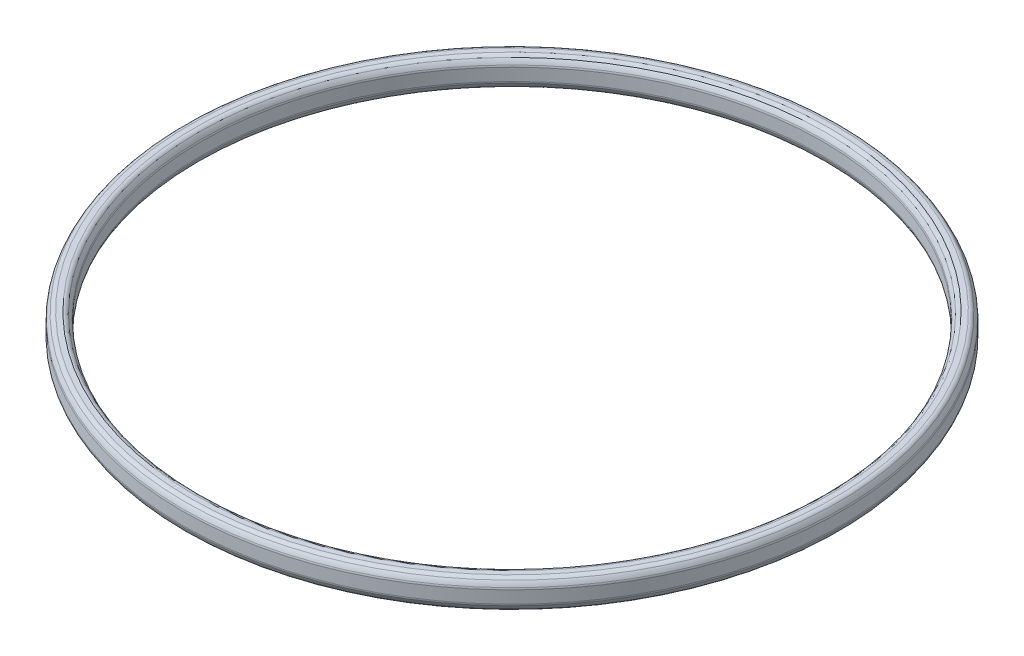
ISO-10303-21;
HEADER;
FILE_DESCRIPTION(('STEP AP214'),'2;1');
FILE_NAME('part.step','',(''),(''),'','','');
FILE_SCHEMA(('AUTOMOTIVE_DESIGN { 1 0 10303 214 1 1 1 1 }'));
ENDSEC;
DATA;
#1=APPLICATION_CONTEXT('core data for automotive mechanical design processes');
#2=APPLICATION_PROTOCOL_DEFINITION('international standard','automotive_design',2000,#1);
#3=PRODUCT_CONTEXT('',#1,'mechanical');
#4=PRODUCT('Part','Part','',(#3));
#5=PRODUCT_RELATED_PRODUCT_CATEGORY('part','',(#4));
#6=PRODUCT_DEFINITION_FORMATION('','',#4);
#7=PRODUCT_DEFINITION_CONTEXT('part definition',#1,'design');
#8=PRODUCT_DEFINITION('design','',#6,#7);
#9=PRODUCT_DEFINITION_SHAPE('','',#8);
#10=(LENGTH_UNIT() NAMED_UNIT(*) SI_UNIT(.MILLI.,.METRE.));
#11=(NAMED_UNIT(*) PLANE_ANGLE_UNIT() SI_UNIT($,.RADIAN.));
#12=(NAMED_UNIT(*) SI_UNIT($,.STERADIAN.) SOLID_ANGLE_UNIT());
#13=UNCERTAINTY_MEASURE_WITH_UNIT(LENGTH_MEASURE(1.E-05),#10,'distance_accuracy_value','');
#14=(GEOMETRIC_REPRESENTATION_CONTEXT(3) GLOBAL_UNCERTAINTY_ASSIGNED_CONTEXT((#13)) GLOBAL_UNIT_ASSIGNED_CONTEXT((#10,
#11,#12)) REPRESENTATION_CONTEXT('',''));
#15=CARTESIAN_POINT('',(0.,0.,0.));
#16=DIRECTION('',(0.,0.,1.));
#17=DIRECTION('',(1.,0.,0.));
#18=AXIS2_PLACEMENT_3D('',#15,#16,#17);
#19=CARTESIAN_POINT('',(27.2,1.224,0.));
#20=DIRECTION('',(0.,0.,1.));
#21=DIRECTION('',(0.,-1.,0.));
#22=AXIS2_PLACEMENT_3D('',#19,#20,#21);
#23=ELLIPSE('',#22,1.36,0.88888888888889);
#24=CARTESIAN_POINT('',(0.,0.,0.));
#25=DIRECTION('',(0.,-1.,0.));
#26=AXIS1_PLACEMENT('',#24,#25);
#27=SURFACE_OF_REVOLUTION('',#23,#26);
#28=CARTESIAN_POINT('',(0.,2.29152046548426,0.));
#29=DIRECTION('',(0.,-1.,0.));
#30=DIRECTION('',(0.,0.,-1.));
#31=AXIS2_PLACEMENT_3D('',#28,#29,#30);
#32=CIRCLE('',#31,27.7507287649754);
#33=CARTESIAN_POINT('',(0.,2.29152046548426,-27.7507287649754));
#34=VERTEX_POINT('',#33);
#35=EDGE_CURVE('E64',#34,#34,#32,.T.);
#36=ORIENTED_EDGE('',*,*,#35,.T.);
#37=EDGE_LOOP('',(#36));
#38=FACE_BOUND('',#37,.T.);
#39=CARTESIAN_POINT('',(0.,1.89539244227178,0.));
#40=DIRECTION('',(0.,-1.,0.));
#41=DIRECTION('',(0.,0.,-1.));
#42=AXIS2_PLACEMENT_3D('',#39,#40,#41);
#43=CIRCLE('',#42,27.9730211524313);
#44=CARTESIAN_POINT('',(0.,1.89539244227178,-27.9730211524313));
#45=VERTEX_POINT('',#44);
#46=EDGE_CURVE('E67',#45,#45,#43,.F.);
#47=ORIENTED_EDGE('',*,*,#46,.T.);
#48=EDGE_LOOP('',(#47));
#49=FACE_BOUND('',#48,.T.);
#50=ADVANCED_FACE('F14',(#38,#49),#27,.F.);
#51=CARTESIAN_POINT('',(26.8125423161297,2.448,0.));
#52=DIRECTION('',(0.,1.,0.));
#53=DIRECTION('',(0.,0.,1.));
#54=AXIS2_PLACEMENT_3D('',#51,#52,#53);
#55=PLANE('',#54);
#56=CARTESIAN_POINT('',(0.,2.448,0.));
#57=DIRECTION('',(0.,1.,0.));
#58=DIRECTION('',(0.,0.,1.));
#59=AXIS2_PLACEMENT_3D('',#56,#57,#58);
#60=CIRCLE('',#59,27.4179939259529);
#61=CARTESIAN_POINT('',(0.,2.448,27.4179939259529));
#62=VERTEX_POINT('',#61);
#63=EDGE_CURVE('E58',#62,#62,#60,.T.);
#64=ORIENTED_EDGE('',*,*,#63,.T.);
#65=EDGE_LOOP('',(#64));
#66=FACE_BOUND('',#65,.T.);
#67=CARTESIAN_POINT('',(0.,2.448,0.));
#68=DIRECTION('',(0.,1.,0.));
#69=DIRECTION('',(0.,0.,1.));
#70=AXIS2_PLACEMENT_3D('',#67,#68,#69);
#71=CIRCLE('',#70,26.9820060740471);
#72=CARTESIAN_POINT('',(0.,2.448,26.9820060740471));
#73=VERTEX_POINT('',#72);
#74=EDGE_CURVE('E61',#73,#73,#71,.F.);
#75=ORIENTED_EDGE('',*,*,#74,.T.);
#76=EDGE_LOOP('',(#75));
#77=FACE_BOUND('',#76,.T.);
#78=ADVANCED_FACE('F96',(#66,#77),#55,.T.);
#79=CARTESIAN_POINT('',(27.2,1.224,0.));
#80=DIRECTION('',(0.,0.,1.));
#81=DIRECTION('',(0.,-1.,0.));
#82=AXIS2_PLACEMENT_3D('',#79,#80,#81);
#83=ELLIPSE('',#82,1.36,0.88888888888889);
#84=CARTESIAN_POINT('',(0.,0.,0.));
#85=DIRECTION('',(0.,-1.,0.));
#86=AXIS1_PLACEMENT('',#84,#85);
#87=SURFACE_OF_REVOLUTION('',#83,#86);
#88=CARTESIAN_POINT('',(0.,2.29152046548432,0.));
#89=DIRECTION('',(0.,-1.,0.));
#90=DIRECTION('',(0.,0.,-1.));
#91=AXIS2_PLACEMENT_3D('',#88,#89,#90);
#92=CIRCLE('',#91,26.6492712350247);
#93=CARTESIAN_POINT('',(0.,2.29152046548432,-26.6492712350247));
#94=VERTEX_POINT('',#93);
#95=EDGE_CURVE('E52',#94,#94,#92,.F.);
#96=ORIENTED_EDGE('',*,*,#95,.T.);
#97=EDGE_LOOP('',(#96));
#98=FACE_BOUND('',#97,.T.);
#99=CARTESIAN_POINT('',(0.,1.89539244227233,0.));
#100=DIRECTION('',(0.,-1.,0.));
#101=DIRECTION('',(0.,0.,-1.));
#102=AXIS2_PLACEMENT_3D('',#99,#100,#101);
#103=CIRCLE('',#102,26.426978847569);
#104=CARTESIAN_POINT('',(0.,1.89539244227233,-26.426978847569));
#105=VERTEX_POINT('',#104);
#106=EDGE_CURVE('E55',#105,#105,#103,.T.);
#107=ORIENTED_EDGE('',*,*,#106,.T.);
#108=EDGE_LOOP('',(#107));
#109=FACE_BOUND('',#108,.T.);
#110=ADVANCED_FACE('F92',(#98,#109),#87,.F.);
#111=CARTESIAN_POINT('',(0.,0.,0.));
#112=DIRECTION('',(0.,-1.,0.));
#113=DIRECTION('',(0.,0.,-1.));
#114=AXIS2_PLACEMENT_3D('',#111,#112,#113);
#115=CYLINDRICAL_SURFACE('',#114,26.4);
#116=CARTESIAN_POINT('',(0.,1.74511980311,0.));
#117=DIRECTION('',(0.,1.,0.));
#118=DIRECTION('',(0.,0.,1.));
#119=AXIS2_PLACEMENT_3D('',#116,#117,#118);
#120=CIRCLE('',#119,26.4);
#121=CARTESIAN_POINT('',(0.,1.74511980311,26.4));
#122=VERTEX_POINT('',#121);
#123=EDGE_CURVE('E46',#122,#122,#120,.T.);
#124=ORIENTED_EDGE('',*,*,#123,.T.);
#125=EDGE_LOOP('',(#124));
#126=FACE_BOUND('',#125,.T.);
#127=CARTESIAN_POINT('',(0.,0.702880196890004,0.));
#128=DIRECTION('',(0.,1.,0.));
#129=DIRECTION('',(0.,0.,1.));
#130=AXIS2_PLACEMENT_3D('',#127,#128,#129);
#131=CIRCLE('',#130,26.4);
#132=CARTESIAN_POINT('',(0.,0.702880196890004,26.4));
#133=VERTEX_POINT('',#132);
#134=EDGE_CURVE('E49',#133,#133,#131,.F.);
#135=ORIENTED_EDGE('',*,*,#134,.T.);
#136=EDGE_LOOP('',(#135));
#137=FACE_BOUND('',#136,.T.);
#138=ADVANCED_FACE('F88',(#126,#137),#115,.F.);
#139=CARTESIAN_POINT('',(27.2,1.224,0.));
#140=DIRECTION('',(0.,0.,1.));
#141=DIRECTION('',(0.,-1.,0.));
#142=AXIS2_PLACEMENT_3D('',#139,#140,#141);
#143=ELLIPSE('',#142,1.36,0.88888888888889);
#144=CARTESIAN_POINT('',(0.,0.,0.));
#145=DIRECTION('',(0.,-1.,0.));
#146=AXIS1_PLACEMENT('',#144,#145);
#147=SURFACE_OF_REVOLUTION('',#143,#146);
#148=CARTESIAN_POINT('',(0.,0.552607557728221,0.));
#149=DIRECTION('',(0.,-1.,0.));
#150=DIRECTION('',(0.,0.,-1.));
#151=AXIS2_PLACEMENT_3D('',#148,#149,#150);
#152=CIRCLE('',#151,26.4269788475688);
#153=CARTESIAN_POINT('',(0.,0.552607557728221,-26.4269788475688));
#154=VERTEX_POINT('',#153);
#155=EDGE_CURVE('E40',#154,#154,#152,.F.);
#156=ORIENTED_EDGE('',*,*,#155,.T.);
#157=EDGE_LOOP('',(#156));
#158=FACE_BOUND('',#157,.T.);
#159=CARTESIAN_POINT('',(0.,0.156479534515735,0.));
#160=DIRECTION('',(0.,-1.,0.));
#161=DIRECTION('',(0.,0.,-1.));
#162=AXIS2_PLACEMENT_3D('',#159,#160,#161);
#163=CIRCLE('',#162,26.6492712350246);
#164=CARTESIAN_POINT('',(0.,0.156479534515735,-26.6492712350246));
#165=VERTEX_POINT('',#164);
#166=EDGE_CURVE('E43',#165,#165,#163,.T.);
#167=ORIENTED_EDGE('',*,*,#166,.T.);
#168=EDGE_LOOP('',(#167));
#169=FACE_BOUND('',#168,.T.);
#170=ADVANCED_FACE('F84',(#158,#169),#147,.F.);
#171=CARTESIAN_POINT('',(26.8125423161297,0.,0.));
#172=DIRECTION('',(0.,-1.,0.));
#173=DIRECTION('',(0.,0.,-1.));
#174=AXIS2_PLACEMENT_3D('',#171,#172,#173);
#175=PLANE('',#174);
#176=CARTESIAN_POINT('',(0.,0.,0.));
#177=DIRECTION('',(0.,-1.,0.));
#178=DIRECTION('',(0.,0.,-1.));
#179=AXIS2_PLACEMENT_3D('',#176,#177,#178);
#180=CIRCLE('',#179,26.9820060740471);
#181=CARTESIAN_POINT('',(0.,0.,-26.9820060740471));
#182=VERTEX_POINT('',#181);
#183=EDGE_CURVE('E34',#182,#182,#180,.F.);
#184=ORIENTED_EDGE('',*,*,#183,.T.);
#185=EDGE_LOOP('',(#184));
#186=FACE_BOUND('',#185,.T.);
#187=CARTESIAN_POINT('',(0.,0.,0.));
#188=DIRECTION('',(0.,-1.,0.));
#189=DIRECTION('',(0.,0.,-1.));
#190=AXIS2_PLACEMENT_3D('',#187,#188,#189);
#191=CIRCLE('',#190,27.4179939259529);
#192=CARTESIAN_POINT('',(0.,0.,-27.4179939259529));
#193=VERTEX_POINT('',#192);
#194=EDGE_CURVE('E37',#193,#193,#191,.T.);
#195=ORIENTED_EDGE('',*,*,#194,.T.);
#196=EDGE_LOOP('',(#195));
#197=FACE_BOUND('',#196,.T.);
#198=ADVANCED_FACE('F80',(#186,#197),#175,.T.);
#199=CARTESIAN_POINT('',(27.2,1.224,0.));
#200=DIRECTION('',(0.,0.,1.));
#201=DIRECTION('',(0.,-1.,0.));
#202=AXIS2_PLACEMENT_3D('',#199,#200,#201);
#203=ELLIPSE('',#202,1.36,0.88888888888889);
#204=CARTESIAN_POINT('',(0.,0.,0.));
#205=DIRECTION('',(0.,-1.,0.));
#206=AXIS1_PLACEMENT('',#204,#205);
#207=SURFACE_OF_REVOLUTION('',#203,#206);
#208=CARTESIAN_POINT('',(0.,0.156479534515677,0.));
#209=DIRECTION('',(0.,-1.,0.));
#210=DIRECTION('',(0.,0.,-1.));
#211=AXIS2_PLACEMENT_3D('',#208,#209,#210);
#212=CIRCLE('',#211,27.7507287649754);
#213=CARTESIAN_POINT('',(0.,0.156479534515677,-27.7507287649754));
#214=VERTEX_POINT('',#213);
#215=EDGE_CURVE('E25',#214,#214,#212,.F.);
#216=ORIENTED_EDGE('',*,*,#215,.T.);
#217=EDGE_LOOP('',(#216));
#218=FACE_BOUND('',#217,.T.);
#219=CARTESIAN_POINT('',(0.,0.552607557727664,0.));
#220=DIRECTION('',(0.,-1.,0.));
#221=DIRECTION('',(0.,0.,-1.));
#222=AXIS2_PLACEMENT_3D('',#219,#220,#221);
#223=CIRCLE('',#222,27.973021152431);
#224=CARTESIAN_POINT('',(0.,0.552607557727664,-27.973021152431));
#225=VERTEX_POINT('',#224);
#226=EDGE_CURVE('E29',#225,#225,#223,.T.);
#227=ORIENTED_EDGE('',*,*,#226,.T.);
#228=EDGE_LOOP('',(#227));
#229=FACE_BOUND('',#228,.T.);
#230=ADVANCED_FACE('F75',(#218,#229),#207,.F.);
#231=CARTESIAN_POINT('',(0.,0.,0.));
#232=DIRECTION('',(0.,-1.,0.));
#233=DIRECTION('',(0.,0.,-1.));
#234=AXIS2_PLACEMENT_3D('',#231,#232,#233);
#235=CYLINDRICAL_SURFACE('',#234,28.);
#236=CARTESIAN_POINT('',(0.,0.702880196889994,0.));
#237=DIRECTION('',(0.,1.,0.));
#238=DIRECTION('',(0.,0.,1.));
#239=AXIS2_PLACEMENT_3D('',#236,#237,#238);
#240=CIRCLE('',#239,28.);
#241=CARTESIAN_POINT('',(0.,0.702880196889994,28.));
#242=VERTEX_POINT('',#241);
#243=EDGE_CURVE('E10',#242,#242,#240,.T.);
#244=ORIENTED_EDGE('',*,*,#243,.T.);
#245=EDGE_LOOP('',(#244));
#246=FACE_BOUND('',#245,.T.);
#247=CARTESIAN_POINT('',(0.,1.74511980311,0.));
#248=DIRECTION('',(0.,1.,0.));
#249=DIRECTION('',(0.,0.,1.));
#250=AXIS2_PLACEMENT_3D('',#247,#248,#249);
#251=CIRCLE('',#250,28.);
#252=CARTESIAN_POINT('',(0.,1.74511980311,28.));
#253=VERTEX_POINT('',#252);
#254=EDGE_CURVE('E21',#253,#253,#251,.F.);
#255=ORIENTED_EDGE('',*,*,#254,.T.);
#256=EDGE_LOOP('',(#255));
#257=FACE_BOUND('',#256,.T.);
#258=ADVANCED_FACE('F79',(#246,#257),#235,.T.);
#259=CARTESIAN_POINT('',(0.,2.016,0.));
#260=DIRECTION('',(0.,-1.,0.));
#261=DIRECTION('',(0.,0.,-1.));
#262=AXIS2_PLACEMENT_3D('',#259,#260,#261);
#263=TOROIDAL_SURFACE('',#262,27.4179939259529,0.432);
#264=ORIENTED_EDGE('',*,*,#63,.F.);
#265=EDGE_LOOP('',(#264));
#266=FACE_BOUND('',#265,.T.);
#267=ORIENTED_EDGE('',*,*,#35,.F.);
#268=EDGE_LOOP('',(#267));
#269=FACE_BOUND('',#268,.T.);
#270=ADVANCED_FACE('F105',(#266,#269),#263,.T.);
#271=CARTESIAN_POINT('',(0.,2.016,0.));
#272=DIRECTION('',(0.,-1.,0.));
#273=DIRECTION('',(0.,0.,-1.));
#274=AXIS2_PLACEMENT_3D('',#271,#272,#273);
#275=TOROIDAL_SURFACE('',#274,26.9820060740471,0.432);
#276=ORIENTED_EDGE('',*,*,#95,.F.);
#277=EDGE_LOOP('',(#276));
#278=FACE_BOUND('',#277,.T.);
#279=ORIENTED_EDGE('',*,*,#74,.F.);
#280=EDGE_LOOP('',(#279));
#281=FACE_BOUND('',#280,.T.);
#282=ADVANCED_FACE('F108',(#278,#281),#275,.T.);
#283=CARTESIAN_POINT('',(0.,1.74511980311,0.));
#284=DIRECTION('',(0.,1.,0.));
#285=DIRECTION('',(0.,0.,1.));
#286=AXIS2_PLACEMENT_3D('',#283,#284,#285);
#287=TOROIDAL_SURFACE('',#286,26.8320000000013,0.432);
#288=ORIENTED_EDGE('',*,*,#123,.F.);
#289=EDGE_LOOP('',(#288));
#290=FACE_BOUND('',#289,.T.);
#291=ORIENTED_EDGE('',*,*,#106,.F.);
#292=EDGE_LOOP('',(#291));
#293=FACE_BOUND('',#292,.T.);
#294=ADVANCED_FACE('F112',(#290,#293),#287,.T.);
#295=CARTESIAN_POINT('',(0.,0.702880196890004,0.));
#296=DIRECTION('',(0.,1.,0.));
#297=DIRECTION('',(0.,0.,1.));
#298=AXIS2_PLACEMENT_3D('',#295,#296,#297);
#299=TOROIDAL_SURFACE('',#298,26.8320000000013,0.432);
#300=ORIENTED_EDGE('',*,*,#155,.F.);
#301=EDGE_LOOP('',(#300));
#302=FACE_BOUND('',#301,.T.);
#303=ORIENTED_EDGE('',*,*,#134,.F.);
#304=EDGE_LOOP('',(#303));
#305=FACE_BOUND('',#304,.T.);
#306=ADVANCED_FACE('F116',(#302,#305),#299,.T.);
#307=CARTESIAN_POINT('',(0.,0.432000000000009,0.));
#308=DIRECTION('',(0.,-1.,0.));
#309=DIRECTION('',(0.,0.,-1.));
#310=AXIS2_PLACEMENT_3D('',#307,#308,#309);
#311=TOROIDAL_SURFACE('',#310,26.9820060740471,0.432);
#312=ORIENTED_EDGE('',*,*,#183,.F.);
#313=EDGE_LOOP('',(#312));
#314=FACE_BOUND('',#313,.T.);
#315=ORIENTED_EDGE('',*,*,#166,.F.);
#316=EDGE_LOOP('',(#315));
#317=FACE_BOUND('',#316,.T.);
#318=ADVANCED_FACE('F120',(#314,#317),#311,.T.);
#319=CARTESIAN_POINT('',(0.,0.432000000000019,0.));
#320=DIRECTION('',(0.,-1.,0.));
#321=DIRECTION('',(0.,0.,-1.));
#322=AXIS2_PLACEMENT_3D('',#319,#320,#321);
#323=TOROIDAL_SURFACE('',#322,27.4179939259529,0.432);
#324=ORIENTED_EDGE('',*,*,#215,.F.);
#325=EDGE_LOOP('',(#324));
#326=FACE_BOUND('',#325,.T.);
#327=ORIENTED_EDGE('',*,*,#194,.F.);
#328=EDGE_LOOP('',(#327));
#329=FACE_BOUND('',#328,.T.);
#330=ADVANCED_FACE('F124',(#326,#329),#323,.T.);
#331=CARTESIAN_POINT('',(0.,0.702880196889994,0.));
#332=DIRECTION('',(0.,1.,0.));
#333=DIRECTION('',(0.,0.,1.));
#334=AXIS2_PLACEMENT_3D('',#331,#332,#333);
#335=TOROIDAL_SURFACE('',#334,27.5679999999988,0.432);
#336=ORIENTED_EDGE('',*,*,#243,.F.);
#337=EDGE_LOOP('',(#336));
#338=FACE_BOUND('',#337,.T.);
#339=ORIENTED_EDGE('',*,*,#226,.F.);
#340=EDGE_LOOP('',(#339));
#341=FACE_BOUND('',#340,.T.);
#342=ADVANCED_FACE('F127',(#338,#341),#335,.T.);
#343=CARTESIAN_POINT('',(0.,1.74511980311,0.));
#344=DIRECTION('',(0.,1.,0.));
#345=DIRECTION('',(0.,0.,1.));
#346=AXIS2_PLACEMENT_3D('',#343,#344,#345);
#347=TOROIDAL_SURFACE('',#346,27.5679999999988,0.432);
#348=ORIENTED_EDGE('',*,*,#46,.F.);
#349=EDGE_LOOP('',(#348));
#350=FACE_BOUND('',#349,.T.);
#351=ORIENTED_EDGE('',*,*,#254,.F.);
#352=EDGE_LOOP('',(#351));
#353=FACE_BOUND('',#352,.T.);
#354=ADVANCED_FACE('F16',(#350,#353),#347,.T.);
#355=CLOSED_SHELL('',(#50,#78,#110,#138,#170,#198,#230,#258,#270,#282,#294,#306,#318,#330,#342,#354));
#356=MANIFOLD_SOLID_BREP('B1',#355);
#357=ADVANCED_BREP_SHAPE_REPRESENTATION('',(#18,#356),#14);
#358=SHAPE_DEFINITION_REPRESENTATION(#9,#357);
ENDSEC;
END-ISO-10303-21;
